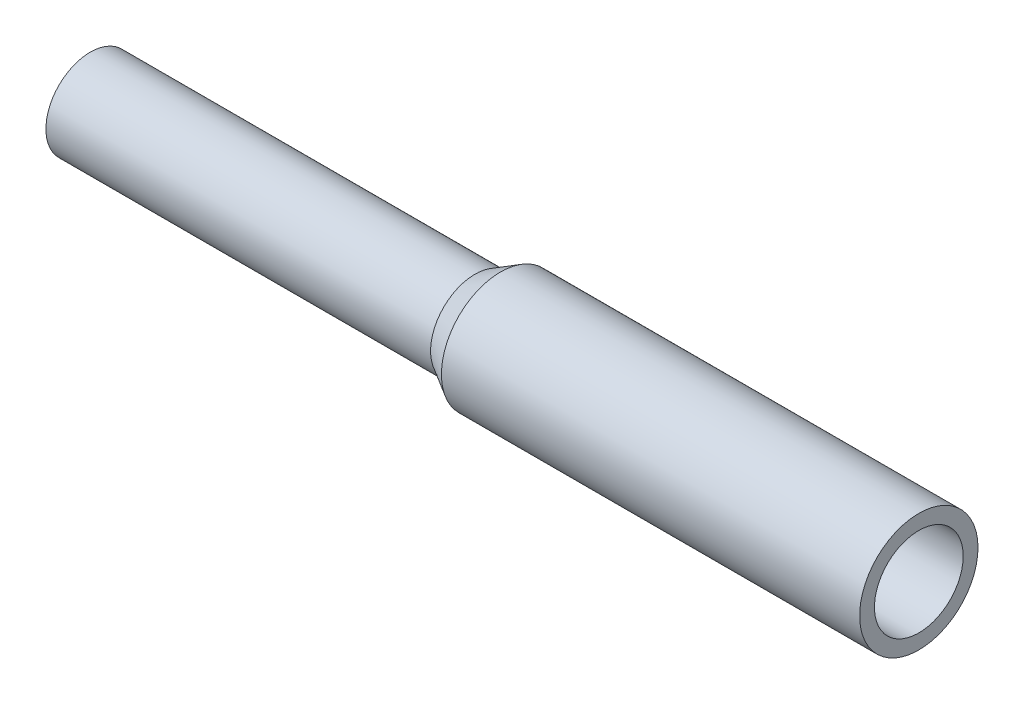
from build123d import *


with BuildPart() as part:
    # Esquisse1 → R_volution1 (revolve)
    with BuildSketch(Plane.XY, mode=Mode.PRIVATE) as r_volution1_sk:
        Polygon((0, 1.5), (-12, 1.5), (-12.901290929, 0), (-28, 0), (-28, 1.5), (-15, 1.5), (-14.133974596, 2), (0, 2), align=None)
    revolve(r_volution1_sk.sketch.rotate(Axis((0, 0, 0), (-1, 0, 0)), 90), axis=Axis((0, 0, 0), (-1, 0, 0)))


solid = part.part
